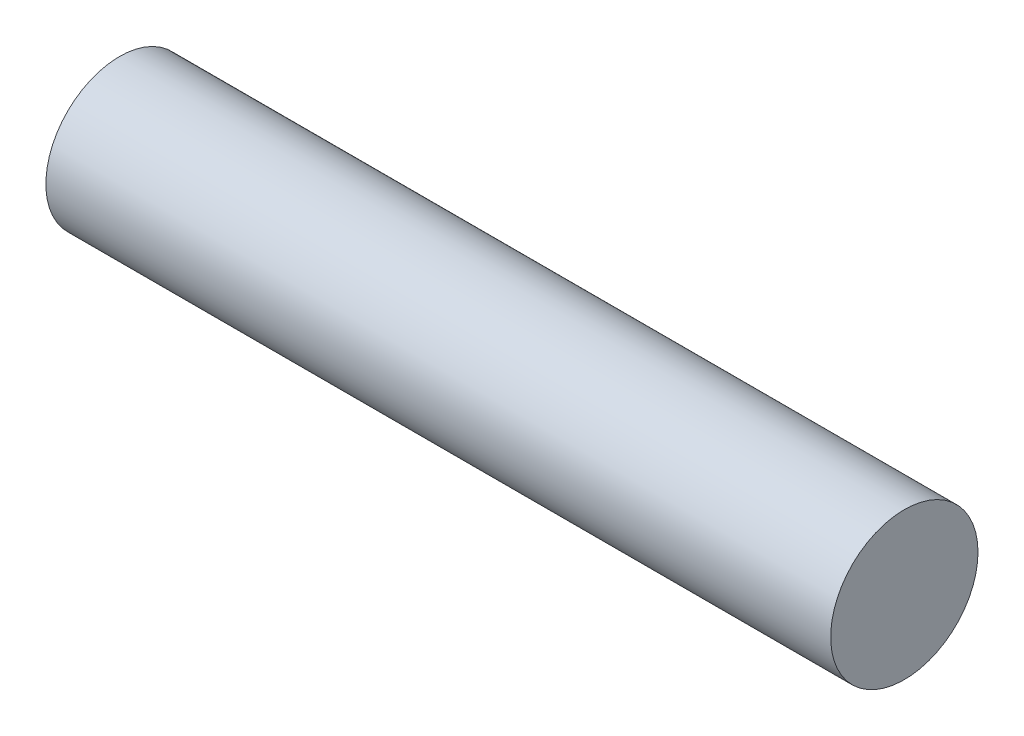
from build123d import *

# Parameters (mm, degrees)
SKIZZE1_W = 159.796105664
SKIZZE1_H = 15


with BuildPart() as part:
    # Skizze1 → Rotation1 (revolve)
    with BuildSketch(Plane.XY, mode=Mode.PRIVATE) as rotation1_sk:
        with Locations((-79.898052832, 7.5)):
            Rectangle(SKIZZE1_W, SKIZZE1_H)
    revolve(rotation1_sk.sketch.rotate(Axis((0, 0, 0), (-1, 0, 0)), 90), axis=Axis((0, 0, 0), (-1, 0, 0)))


solid = part.part
